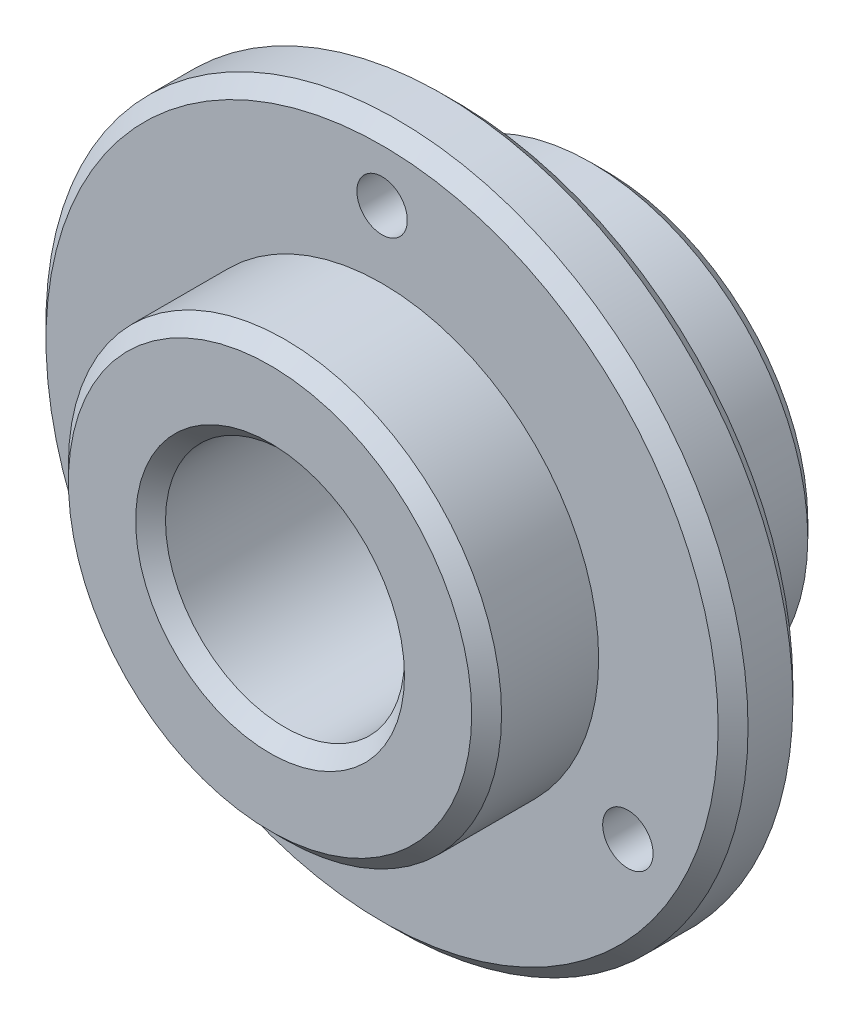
ISO-10303-21;
HEADER;
FILE_DESCRIPTION(('STEP AP214'),'2;1');
FILE_NAME('part.step','',(''),(''),'','','');
FILE_SCHEMA(('AUTOMOTIVE_DESIGN { 1 0 10303 214 1 1 1 1 }'));
ENDSEC;
DATA;
#1=APPLICATION_CONTEXT('core data for automotive mechanical design processes');
#2=APPLICATION_PROTOCOL_DEFINITION('international standard','automotive_design',2000,#1);
#3=PRODUCT_CONTEXT('',#1,'mechanical');
#4=PRODUCT('Part','Part','',(#3));
#5=PRODUCT_RELATED_PRODUCT_CATEGORY('part','',(#4));
#6=PRODUCT_DEFINITION_FORMATION('','',#4);
#7=PRODUCT_DEFINITION_CONTEXT('part definition',#1,'design');
#8=PRODUCT_DEFINITION('design','',#6,#7);
#9=PRODUCT_DEFINITION_SHAPE('','',#8);
#10=(LENGTH_UNIT() NAMED_UNIT(*) SI_UNIT(.MILLI.,.METRE.));
#11=(NAMED_UNIT(*) PLANE_ANGLE_UNIT() SI_UNIT($,.RADIAN.));
#12=(NAMED_UNIT(*) SI_UNIT($,.STERADIAN.) SOLID_ANGLE_UNIT());
#13=UNCERTAINTY_MEASURE_WITH_UNIT(LENGTH_MEASURE(1.E-05),#10,'distance_accuracy_value','');
#14=(GEOMETRIC_REPRESENTATION_CONTEXT(3) GLOBAL_UNCERTAINTY_ASSIGNED_CONTEXT((#13)) GLOBAL_UNIT_ASSIGNED_CONTEXT((#10,
#11,#12)) REPRESENTATION_CONTEXT('',''));
#15=CARTESIAN_POINT('',(0.,0.,0.));
#16=DIRECTION('',(0.,0.,1.));
#17=DIRECTION('',(1.,0.,0.));
#18=AXIS2_PLACEMENT_3D('',#15,#16,#17);
#19=CARTESIAN_POINT('',(-51.,-60.,10.));
#20=DIRECTION('',(0.,0.,1.));
#21=DIRECTION('',(1.,0.,0.));
#22=AXIS2_PLACEMENT_3D('',#19,#20,#21);
#23=PLANE('',#22);
#24=CARTESIAN_POINT('',(-51.,-60.,10.));
#25=DIRECTION('',(0.,0.,1.));
#26=DIRECTION('',(1.,0.,0.));
#27=AXIS2_PLACEMENT_3D('',#24,#25,#26);
#28=CIRCLE('',#27,45.);
#29=CARTESIAN_POINT('',(-5.99999999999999,-60.,10.));
#30=VERTEX_POINT('',#29);
#31=EDGE_CURVE('E50',#30,#30,#28,.T.);
#32=ORIENTED_EDGE('',*,*,#31,.T.);
#33=EDGE_LOOP('',(#32));
#34=FACE_BOUND('',#33,.T.);
#35=CARTESIAN_POINT('',(-83.9089653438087,-79.,10.));
#36=DIRECTION('',(0.,0.,-1.));
#37=DIRECTION('',(-1.,0.,0.));
#38=AXIS2_PLACEMENT_3D('',#35,#36,#37);
#39=CIRCLE('',#38,3.375);
#40=CARTESIAN_POINT('',(-87.2839653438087,-79.,10.));
#41=VERTEX_POINT('',#40);
#42=EDGE_CURVE('E77',#41,#41,#39,.T.);
#43=ORIENTED_EDGE('',*,*,#42,.T.);
#44=EDGE_LOOP('',(#43));
#45=FACE_BOUND('',#44,.T.);
#46=CARTESIAN_POINT('',(-18.0910346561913,-78.9999999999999,10.));
#47=DIRECTION('',(0.,0.,-1.));
#48=DIRECTION('',(-1.,0.,0.));
#49=AXIS2_PLACEMENT_3D('',#46,#47,#48);
#50=CIRCLE('',#49,3.375);
#51=CARTESIAN_POINT('',(-21.4660346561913,-78.9999999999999,10.));
#52=VERTEX_POINT('',#51);
#53=EDGE_CURVE('E83',#52,#52,#50,.T.);
#54=ORIENTED_EDGE('',*,*,#53,.T.);
#55=EDGE_LOOP('',(#54));
#56=FACE_BOUND('',#55,.T.);
#57=CARTESIAN_POINT('',(-51.,-22.,10.));
#58=DIRECTION('',(0.,0.,-1.));
#59=DIRECTION('',(-1.,0.,0.));
#60=AXIS2_PLACEMENT_3D('',#57,#58,#59);
#61=CIRCLE('',#60,3.375);
#62=CARTESIAN_POINT('',(-54.375,-22.,10.));
#63=VERTEX_POINT('',#62);
#64=EDGE_CURVE('E89',#63,#63,#61,.T.);
#65=ORIENTED_EDGE('',*,*,#64,.T.);
#66=EDGE_LOOP('',(#65));
#67=FACE_BOUND('',#66,.T.);
#68=CARTESIAN_POINT('',(-51.,-60.,10.));
#69=DIRECTION('',(0.,0.,1.));
#70=DIRECTION('',(1.,0.,0.));
#71=AXIS2_PLACEMENT_3D('',#68,#69,#70);
#72=CIRCLE('',#71,29.);
#73=CARTESIAN_POINT('',(-22.,-60.,10.));
#74=VERTEX_POINT('',#73);
#75=EDGE_CURVE('E95',#74,#74,#72,.T.);
#76=ORIENTED_EDGE('',*,*,#75,.F.);
#77=EDGE_LOOP('',(#76));
#78=FACE_BOUND('',#77,.T.);
#79=ADVANCED_FACE('F30',(#34,#45,#56,#67,#78),#23,.T.);
#80=CARTESIAN_POINT('',(-51.,-60.,-20.));
#81=DIRECTION('',(0.,0.,1.));
#82=DIRECTION('',(1.,0.,0.));
#83=AXIS2_PLACEMENT_3D('',#80,#81,#82);
#84=CYLINDRICAL_SURFACE('',#83,29.);
#85=CARTESIAN_POINT('',(-51.,-60.,-18.));
#86=DIRECTION('',(0.,0.,1.));
#87=DIRECTION('',(1.,0.,0.));
#88=AXIS2_PLACEMENT_3D('',#85,#86,#87);
#89=CIRCLE('',#88,29.);
#90=CARTESIAN_POINT('',(-22.,-60.,-18.));
#91=VERTEX_POINT('',#90);
#92=EDGE_CURVE('E10',#91,#91,#89,.T.);
#93=ORIENTED_EDGE('',*,*,#92,.T.);
#94=EDGE_LOOP('',(#93));
#95=FACE_BOUND('',#94,.T.);
#96=CARTESIAN_POINT('',(-51.,-60.,0.));
#97=DIRECTION('',(0.,0.,1.));
#98=DIRECTION('',(1.,0.,0.));
#99=AXIS2_PLACEMENT_3D('',#96,#97,#98);
#100=CIRCLE('',#99,29.);
#101=CARTESIAN_POINT('',(-22.,-60.,0.));
#102=VERTEX_POINT('',#101);
#103=EDGE_CURVE('E74',#102,#102,#100,.T.);
#104=ORIENTED_EDGE('',*,*,#103,.F.);
#105=EDGE_LOOP('',(#104));
#106=FACE_BOUND('',#105,.T.);
#107=ADVANCED_FACE('F32',(#95,#106),#84,.T.);
#108=CARTESIAN_POINT('',(-51.,-60.,-20.));
#109=DIRECTION('',(0.,0.,1.));
#110=DIRECTION('',(1.,0.,0.));
#111=AXIS2_PLACEMENT_3D('',#108,#109,#110);
#112=PLANE('',#111);
#113=CARTESIAN_POINT('',(-51.,-60.,-20.));
#114=DIRECTION('',(0.,0.,1.));
#115=DIRECTION('',(1.,0.,0.));
#116=AXIS2_PLACEMENT_3D('',#113,#114,#115);
#117=CIRCLE('',#116,18.);
#118=CARTESIAN_POINT('',(-33.,-60.,-20.));
#119=VERTEX_POINT('',#118);
#120=EDGE_CURVE('E56',#119,#119,#117,.T.);
#121=ORIENTED_EDGE('',*,*,#120,.T.);
#122=EDGE_LOOP('',(#121));
#123=FACE_BOUND('',#122,.T.);
#124=CARTESIAN_POINT('',(-51.,-60.,-20.));
#125=DIRECTION('',(0.,0.,1.));
#126=DIRECTION('',(1.,0.,0.));
#127=AXIS2_PLACEMENT_3D('',#124,#125,#126);
#128=CIRCLE('',#127,27.);
#129=CARTESIAN_POINT('',(-24.,-60.,-20.));
#130=VERTEX_POINT('',#129);
#131=EDGE_CURVE('E59',#130,#130,#128,.F.);
#132=ORIENTED_EDGE('',*,*,#131,.T.);
#133=EDGE_LOOP('',(#132));
#134=FACE_BOUND('',#133,.T.);
#135=ADVANCED_FACE('F107',(#123,#134),#112,.F.);
#136=CARTESIAN_POINT('',(-51.,-60.,-20.));
#137=DIRECTION('',(0.,0.,1.));
#138=DIRECTION('',(1.,0.,0.));
#139=AXIS2_PLACEMENT_3D('',#136,#137,#138);
#140=CYLINDRICAL_SURFACE('',#139,16.);
#141=CARTESIAN_POINT('',(-51.,-60.,23.));
#142=DIRECTION('',(0.,0.,1.));
#143=DIRECTION('',(1.,0.,0.));
#144=AXIS2_PLACEMENT_3D('',#141,#142,#143);
#145=CIRCLE('',#144,16.);
#146=CARTESIAN_POINT('',(-35.,-60.,23.));
#147=VERTEX_POINT('',#146);
#148=EDGE_CURVE('E68',#147,#147,#145,.T.);
#149=ORIENTED_EDGE('',*,*,#148,.T.);
#150=EDGE_LOOP('',(#149));
#151=FACE_BOUND('',#150,.T.);
#152=CARTESIAN_POINT('',(-51.,-60.,-18.));
#153=DIRECTION('',(0.,0.,1.));
#154=DIRECTION('',(1.,0.,0.));
#155=AXIS2_PLACEMENT_3D('',#152,#153,#154);
#156=CIRCLE('',#155,16.);
#157=CARTESIAN_POINT('',(-35.,-60.,-18.));
#158=VERTEX_POINT('',#157);
#159=EDGE_CURVE('E71',#158,#158,#156,.F.);
#160=ORIENTED_EDGE('',*,*,#159,.T.);
#161=EDGE_LOOP('',(#160));
#162=FACE_BOUND('',#161,.T.);
#163=ADVANCED_FACE('F118',(#151,#162),#140,.F.);
#164=CARTESIAN_POINT('',(-51.,-60.,0.));
#165=DIRECTION('',(0.,0.,1.));
#166=DIRECTION('',(1.,0.,0.));
#167=AXIS2_PLACEMENT_3D('',#164,#165,#166);
#168=PLANE('',#167);
#169=CARTESIAN_POINT('',(-51.,-60.,0.));
#170=DIRECTION('',(0.,0.,1.));
#171=DIRECTION('',(1.,0.,0.));
#172=AXIS2_PLACEMENT_3D('',#169,#170,#171);
#173=CIRCLE('',#172,45.);
#174=CARTESIAN_POINT('',(-6.00000000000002,-60.,0.));
#175=VERTEX_POINT('',#174);
#176=EDGE_CURVE('E37',#175,#175,#173,.F.);
#177=ORIENTED_EDGE('',*,*,#176,.T.);
#178=EDGE_LOOP('',(#177));
#179=FACE_BOUND('',#178,.T.);
#180=CARTESIAN_POINT('',(-51.,-22.,0.));
#181=DIRECTION('',(0.,0.,-1.));
#182=DIRECTION('',(-1.,0.,0.));
#183=AXIS2_PLACEMENT_3D('',#180,#181,#182);
#184=CIRCLE('',#183,3.375);
#185=CARTESIAN_POINT('',(-54.375,-22.,0.));
#186=VERTEX_POINT('',#185);
#187=EDGE_CURVE('E92',#186,#186,#184,.T.);
#188=ORIENTED_EDGE('',*,*,#187,.F.);
#189=EDGE_LOOP('',(#188));
#190=FACE_BOUND('',#189,.T.);
#191=CARTESIAN_POINT('',(-18.0910346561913,-78.9999999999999,0.));
#192=DIRECTION('',(0.,0.,-1.));
#193=DIRECTION('',(-1.,0.,0.));
#194=AXIS2_PLACEMENT_3D('',#191,#192,#193);
#195=CIRCLE('',#194,3.375);
#196=CARTESIAN_POINT('',(-21.4660346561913,-78.9999999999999,0.));
#197=VERTEX_POINT('',#196);
#198=EDGE_CURVE('E86',#197,#197,#195,.T.);
#199=ORIENTED_EDGE('',*,*,#198,.F.);
#200=EDGE_LOOP('',(#199));
#201=FACE_BOUND('',#200,.T.);
#202=CARTESIAN_POINT('',(-83.9089653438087,-79.,0.));
#203=DIRECTION('',(0.,0.,-1.));
#204=DIRECTION('',(-1.,0.,0.));
#205=AXIS2_PLACEMENT_3D('',#202,#203,#204);
#206=CIRCLE('',#205,3.375);
#207=CARTESIAN_POINT('',(-87.2839653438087,-79.,0.));
#208=VERTEX_POINT('',#207);
#209=EDGE_CURVE('E80',#208,#208,#206,.T.);
#210=ORIENTED_EDGE('',*,*,#209,.F.);
#211=EDGE_LOOP('',(#210));
#212=FACE_BOUND('',#211,.T.);
#213=ORIENTED_EDGE('',*,*,#103,.T.);
#214=EDGE_LOOP('',(#213));
#215=FACE_BOUND('',#214,.T.);
#216=ADVANCED_FACE('F111',(#179,#190,#201,#212,#215),#168,.F.);
#217=CARTESIAN_POINT('',(-51.,-60.,10.));
#218=DIRECTION('',(0.,0.,-1.));
#219=DIRECTION('',(-1.,0.,0.));
#220=AXIS2_PLACEMENT_3D('',#217,#218,#219);
#221=CYLINDRICAL_SURFACE('',#220,47.);
#222=CARTESIAN_POINT('',(-51.,-60.,7.99999999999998));
#223=DIRECTION('',(0.,0.,1.));
#224=DIRECTION('',(1.,0.,0.));
#225=AXIS2_PLACEMENT_3D('',#222,#223,#224);
#226=CIRCLE('',#225,47.);
#227=CARTESIAN_POINT('',(-4.,-60.,7.99999999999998));
#228=VERTEX_POINT('',#227);
#229=EDGE_CURVE('E41',#228,#228,#226,.F.);
#230=ORIENTED_EDGE('',*,*,#229,.T.);
#231=EDGE_LOOP('',(#230));
#232=FACE_BOUND('',#231,.T.);
#233=CARTESIAN_POINT('',(-51.,-60.,2.00000000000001));
#234=DIRECTION('',(0.,0.,1.));
#235=DIRECTION('',(1.,0.,0.));
#236=AXIS2_PLACEMENT_3D('',#233,#234,#235);
#237=CIRCLE('',#236,47.);
#238=CARTESIAN_POINT('',(-4.,-60.,2.00000000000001));
#239=VERTEX_POINT('',#238);
#240=EDGE_CURVE('E45',#239,#239,#237,.T.);
#241=ORIENTED_EDGE('',*,*,#240,.T.);
#242=EDGE_LOOP('',(#241));
#243=FACE_BOUND('',#242,.T.);
#244=ADVANCED_FACE('F113',(#232,#243),#221,.T.);
#245=CARTESIAN_POINT('',(-83.9089653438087,-79.,10.));
#246=DIRECTION('',(0.,0.,-1.));
#247=DIRECTION('',(-1.,0.,0.));
#248=AXIS2_PLACEMENT_3D('',#245,#246,#247);
#249=CYLINDRICAL_SURFACE('',#248,3.375);
#250=ORIENTED_EDGE('',*,*,#42,.F.);
#251=EDGE_LOOP('',(#250));
#252=FACE_BOUND('',#251,.T.);
#253=ORIENTED_EDGE('',*,*,#209,.T.);
#254=EDGE_LOOP('',(#253));
#255=FACE_BOUND('',#254,.T.);
#256=ADVANCED_FACE('F116',(#252,#255),#249,.F.);
#257=CARTESIAN_POINT('',(-18.0910346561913,-78.9999999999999,10.));
#258=DIRECTION('',(0.,0.,-1.));
#259=DIRECTION('',(-1.,0.,0.));
#260=AXIS2_PLACEMENT_3D('',#257,#258,#259);
#261=CYLINDRICAL_SURFACE('',#260,3.375);
#262=ORIENTED_EDGE('',*,*,#53,.F.);
#263=EDGE_LOOP('',(#262));
#264=FACE_BOUND('',#263,.T.);
#265=ORIENTED_EDGE('',*,*,#198,.T.);
#266=EDGE_LOOP('',(#265));
#267=FACE_BOUND('',#266,.T.);
#268=ADVANCED_FACE('F166',(#264,#267),#261,.F.);
#269=CARTESIAN_POINT('',(-51.,-22.,10.));
#270=DIRECTION('',(0.,0.,-1.));
#271=DIRECTION('',(-1.,0.,0.));
#272=AXIS2_PLACEMENT_3D('',#269,#270,#271);
#273=CYLINDRICAL_SURFACE('',#272,3.375);
#274=ORIENTED_EDGE('',*,*,#64,.F.);
#275=EDGE_LOOP('',(#274));
#276=FACE_BOUND('',#275,.T.);
#277=ORIENTED_EDGE('',*,*,#187,.T.);
#278=EDGE_LOOP('',(#277));
#279=FACE_BOUND('',#278,.T.);
#280=ADVANCED_FACE('F159',(#276,#279),#273,.F.);
#281=CARTESIAN_POINT('',(-51.,-60.,25.));
#282=DIRECTION('',(0.,0.,1.));
#283=DIRECTION('',(1.,0.,0.));
#284=AXIS2_PLACEMENT_3D('',#281,#282,#283);
#285=PLANE('',#284);
#286=CARTESIAN_POINT('',(-51.,-60.,25.));
#287=DIRECTION('',(0.,0.,1.));
#288=DIRECTION('',(1.,0.,0.));
#289=AXIS2_PLACEMENT_3D('',#286,#287,#288);
#290=CIRCLE('',#289,18.);
#291=CARTESIAN_POINT('',(-33.,-60.,25.));
#292=VERTEX_POINT('',#291);
#293=EDGE_CURVE('E62',#292,#292,#290,.F.);
#294=ORIENTED_EDGE('',*,*,#293,.T.);
#295=EDGE_LOOP('',(#294));
#296=FACE_BOUND('',#295,.T.);
#297=CARTESIAN_POINT('',(-51.,-60.,25.));
#298=DIRECTION('',(0.,0.,1.));
#299=DIRECTION('',(1.,0.,0.));
#300=AXIS2_PLACEMENT_3D('',#297,#298,#299);
#301=CIRCLE('',#300,27.);
#302=CARTESIAN_POINT('',(-24.,-60.,25.));
#303=VERTEX_POINT('',#302);
#304=EDGE_CURVE('E65',#303,#303,#301,.T.);
#305=ORIENTED_EDGE('',*,*,#304,.T.);
#306=EDGE_LOOP('',(#305));
#307=FACE_BOUND('',#306,.T.);
#308=ADVANCED_FACE('F156',(#296,#307),#285,.T.);
#309=CARTESIAN_POINT('',(-51.,-60.,25.));
#310=DIRECTION('',(0.,0.,-1.));
#311=DIRECTION('',(-1.,0.,0.));
#312=AXIS2_PLACEMENT_3D('',#309,#310,#311);
#313=CYLINDRICAL_SURFACE('',#312,29.);
#314=CARTESIAN_POINT('',(-51.,-60.,23.));
#315=DIRECTION('',(0.,0.,1.));
#316=DIRECTION('',(1.,0.,0.));
#317=AXIS2_PLACEMENT_3D('',#314,#315,#316);
#318=CIRCLE('',#317,29.);
#319=CARTESIAN_POINT('',(-22.,-60.,23.));
#320=VERTEX_POINT('',#319);
#321=EDGE_CURVE('E53',#320,#320,#318,.F.);
#322=ORIENTED_EDGE('',*,*,#321,.T.);
#323=EDGE_LOOP('',(#322));
#324=FACE_BOUND('',#323,.T.);
#325=ORIENTED_EDGE('',*,*,#75,.T.);
#326=EDGE_LOOP('',(#325));
#327=FACE_BOUND('',#326,.T.);
#328=ADVANCED_FACE('F99',(#324,#327),#313,.T.);
#329=CARTESIAN_POINT('',(-51.,-60.,23.));
#330=DIRECTION('',(0.,0.,1.));
#331=DIRECTION('',(1.,0.,0.));
#332=AXIS2_PLACEMENT_3D('',#329,#330,#331);
#333=CONICAL_SURFACE('',#332,16.,0.785398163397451);
#334=ORIENTED_EDGE('',*,*,#293,.F.);
#335=EDGE_LOOP('',(#334));
#336=FACE_BOUND('',#335,.T.);
#337=ORIENTED_EDGE('',*,*,#148,.F.);
#338=EDGE_LOOP('',(#337));
#339=FACE_BOUND('',#338,.T.);
#340=ADVANCED_FACE('F151',(#336,#339),#333,.F.);
#341=CARTESIAN_POINT('',(-51.,-60.,-20.));
#342=DIRECTION('',(0.,0.,-1.));
#343=DIRECTION('',(-1.,0.,0.));
#344=AXIS2_PLACEMENT_3D('',#341,#342,#343);
#345=CONICAL_SURFACE('',#344,18.,0.785398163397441);
#346=ORIENTED_EDGE('',*,*,#159,.F.);
#347=EDGE_LOOP('',(#346));
#348=FACE_BOUND('',#347,.T.);
#349=ORIENTED_EDGE('',*,*,#120,.F.);
#350=EDGE_LOOP('',(#349));
#351=FACE_BOUND('',#350,.T.);
#352=ADVANCED_FACE('F147',(#348,#351),#345,.F.);
#353=CARTESIAN_POINT('',(-51.,-60.,25.));
#354=DIRECTION('',(0.,0.,-1.));
#355=DIRECTION('',(-1.,0.,0.));
#356=AXIS2_PLACEMENT_3D('',#353,#354,#355);
#357=CONICAL_SURFACE('',#356,27.,0.785398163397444);
#358=ORIENTED_EDGE('',*,*,#321,.F.);
#359=EDGE_LOOP('',(#358));
#360=FACE_BOUND('',#359,.T.);
#361=ORIENTED_EDGE('',*,*,#304,.F.);
#362=EDGE_LOOP('',(#361));
#363=FACE_BOUND('',#362,.T.);
#364=ADVANCED_FACE('F143',(#360,#363),#357,.T.);
#365=CARTESIAN_POINT('',(-51.,-60.,10.));
#366=DIRECTION('',(0.,0.,-1.));
#367=DIRECTION('',(-1.,0.,0.));
#368=AXIS2_PLACEMENT_3D('',#365,#366,#367);
#369=CONICAL_SURFACE('',#368,45.,0.785398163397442);
#370=ORIENTED_EDGE('',*,*,#229,.F.);
#371=EDGE_LOOP('',(#370));
#372=FACE_BOUND('',#371,.T.);
#373=ORIENTED_EDGE('',*,*,#31,.F.);
#374=EDGE_LOOP('',(#373));
#375=FACE_BOUND('',#374,.T.);
#376=ADVANCED_FACE('F137',(#372,#375),#369,.T.);
#377=CARTESIAN_POINT('',(-51.,-60.,2.00000000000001));
#378=DIRECTION('',(0.,0.,1.));
#379=DIRECTION('',(1.,0.,0.));
#380=AXIS2_PLACEMENT_3D('',#377,#378,#379);
#381=CONICAL_SURFACE('',#380,47.,0.785398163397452);
#382=ORIENTED_EDGE('',*,*,#176,.F.);
#383=EDGE_LOOP('',(#382));
#384=FACE_BOUND('',#383,.T.);
#385=ORIENTED_EDGE('',*,*,#240,.F.);
#386=EDGE_LOOP('',(#385));
#387=FACE_BOUND('',#386,.T.);
#388=ADVANCED_FACE('F132',(#384,#387),#381,.T.);
#389=CARTESIAN_POINT('',(-51.,-60.,-18.));
#390=DIRECTION('',(0.,0.,1.));
#391=DIRECTION('',(1.,0.,0.));
#392=AXIS2_PLACEMENT_3D('',#389,#390,#391);
#393=CONICAL_SURFACE('',#392,29.,0.785398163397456);
#394=ORIENTED_EDGE('',*,*,#131,.F.);
#395=EDGE_LOOP('',(#394));
#396=FACE_BOUND('',#395,.T.);
#397=ORIENTED_EDGE('',*,*,#92,.F.);
#398=EDGE_LOOP('',(#397));
#399=FACE_BOUND('',#398,.T.);
#400=ADVANCED_FACE('F129',(#396,#399),#393,.T.);
#401=CLOSED_SHELL('',(#79,#107,#135,#163,#216,#244,#256,#268,#280,#308,#328,#340,#352,#364,#376,
#388,#400));
#402=MANIFOLD_SOLID_BREP('B2',#401);
#403=ADVANCED_BREP_SHAPE_REPRESENTATION('',(#18,#402),#14);
#404=SHAPE_DEFINITION_REPRESENTATION(#9,#403);
ENDSEC;
END-ISO-10303-21;
